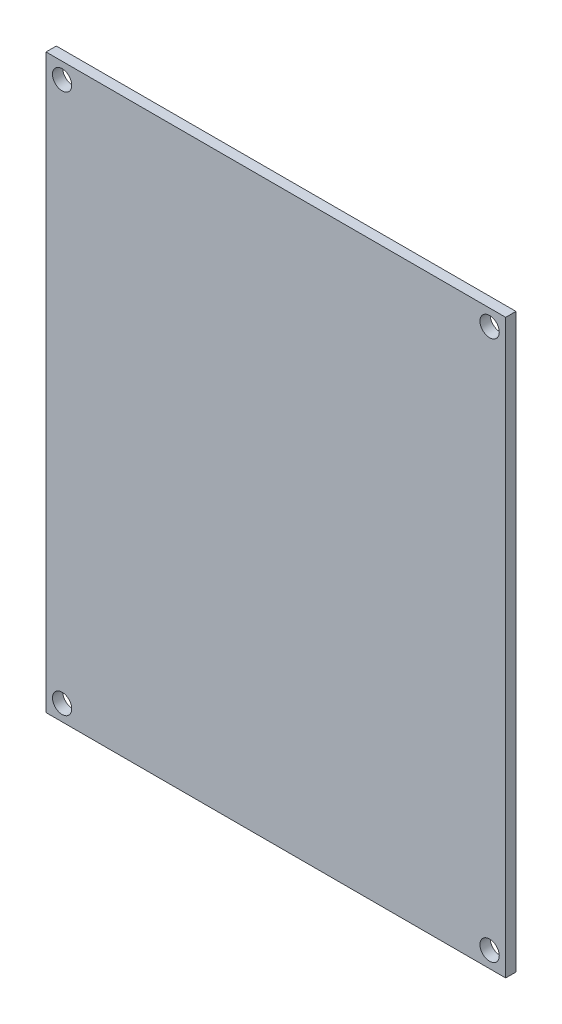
from build123d import *

# Parameters (mm, degrees)
SKETCH1_W           = 71.5
SKETCH1_H           = 89
SKETCH1_R           = 1.5
BOSS_EXTRUDE1_DEPTH = 1.6


with BuildPart() as part:
    # Sketch1 → Boss-Extrude1 (new body)
    with BuildSketch(Plane.XY):
        with Locations((51.75, 0)):
            Rectangle(SKETCH1_W, SKETCH1_H)
        with Locations((18.5, -42)):
            Circle(SKETCH1_R, mode=Mode.SUBTRACT)
        with Locations((85, -42)):
            Circle(SKETCH1_R, mode=Mode.SUBTRACT)
        with Locations((85, 42)):
            Circle(SKETCH1_R, mode=Mode.SUBTRACT)
        with Locations((18.5, 42)):
            Circle(SKETCH1_R, mode=Mode.SUBTRACT)
    extrude(amount=BOSS_EXTRUDE1_DEPTH)


solid = part.part
